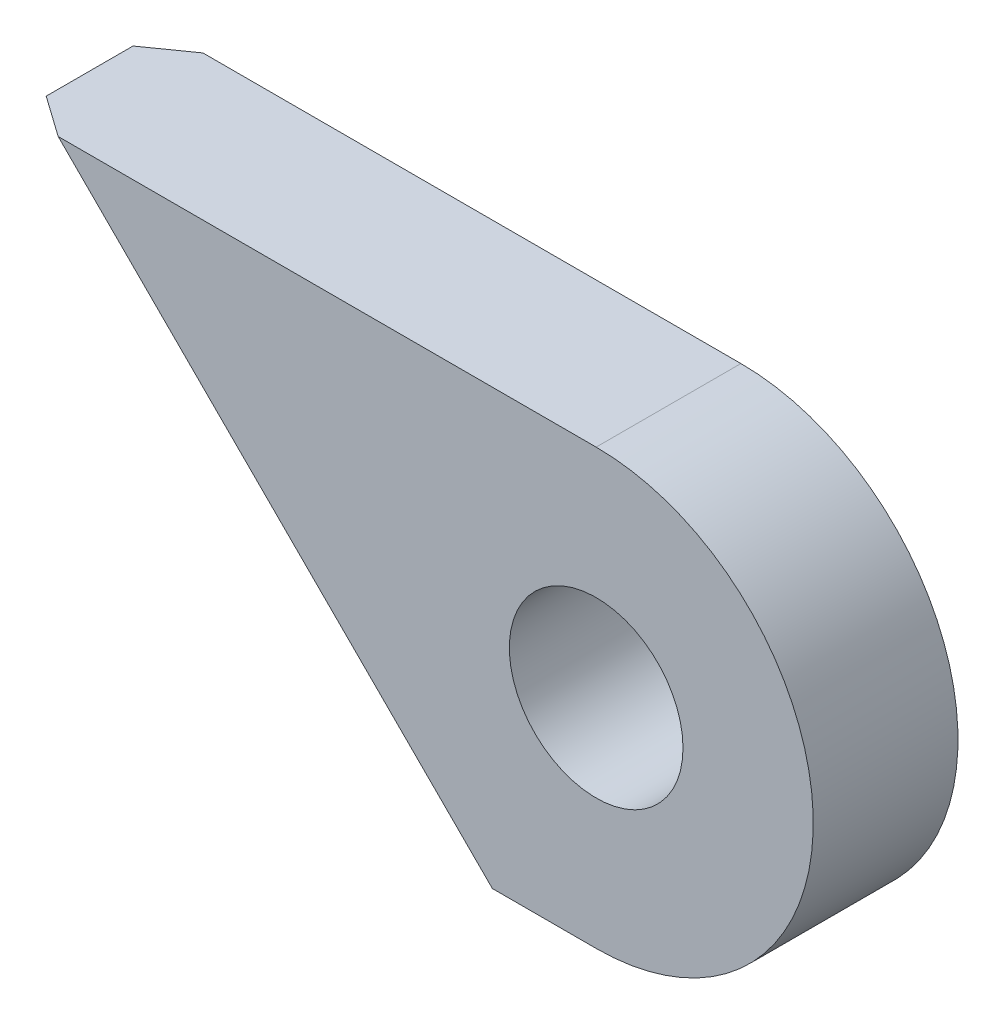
from build123d import *

# Parameters (mm, degrees)
EXTRUSION1_DEPTH        = 10
ESQUISSE2_R             = 6
ENL_V_MAT_EXTRU_1_DEPTH = 10
CHANFREIN1_SIZE         = 2


with BuildPart() as part:
    # Esquisse1 → Extrusion1 (new body)
    with BuildSketch(Plane.XY):
        with BuildLine():
            Line((0, 0), (30, -30))
            Line((30, -30), (40, -30))
            ThreePointArc((40, -30), (55, -15), (40, 0))
            Line((40, 0), (0, 0))
        make_face()
    extrude(amount=EXTRUSION1_DEPTH)

    # Esquisse2 → Enl_v. mat.-Extru.1 (cut)
    with BuildSketch(Plane.XY.offset(10)):
        with Locations((40, -15)):
            Circle(ESQUISSE2_R)
    extrude(amount=-ENL_V_MAT_EXTRU_1_DEPTH, mode=Mode.SUBTRACT)

    # Chanfrein1
    chanfrein1_edges = [part.edges().sort_by_distance(p)[0] for p in [
        (15, -15, 0),
        (15, -15, 10),
    ]]
    chamfer(chanfrein1_edges, length=CHANFREIN1_SIZE)


solid = part.part
